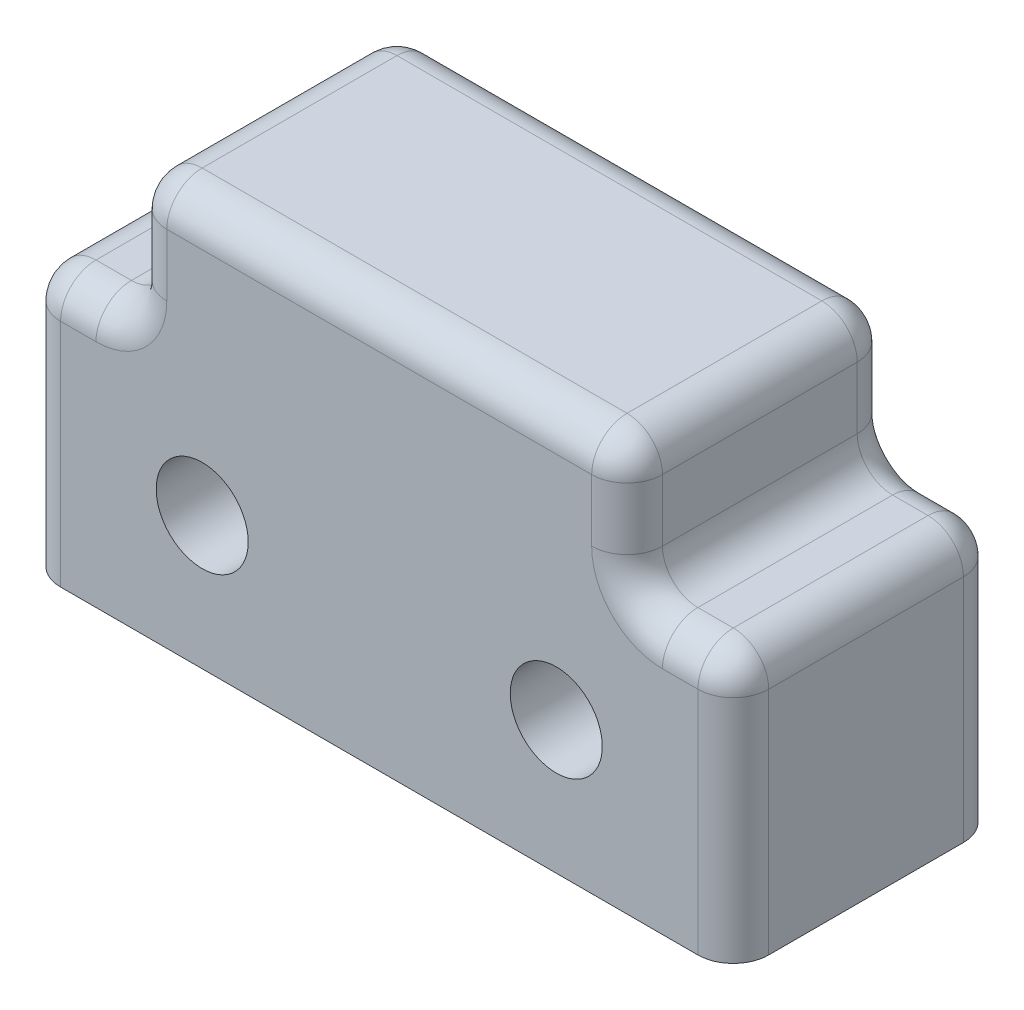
ISO-10303-21;
HEADER;
FILE_DESCRIPTION(('STEP AP214'),'2;1');
FILE_NAME('part.step','',(''),(''),'','','');
FILE_SCHEMA(('AUTOMOTIVE_DESIGN { 1 0 10303 214 1 1 1 1 }'));
ENDSEC;
DATA;
#1=APPLICATION_CONTEXT('core data for automotive mechanical design processes');
#2=APPLICATION_PROTOCOL_DEFINITION('international standard','automotive_design',2000,#1);
#3=PRODUCT_CONTEXT('',#1,'mechanical');
#4=PRODUCT('Part','Part','',(#3));
#5=PRODUCT_RELATED_PRODUCT_CATEGORY('part','',(#4));
#6=PRODUCT_DEFINITION_FORMATION('','',#4);
#7=PRODUCT_DEFINITION_CONTEXT('part definition',#1,'design');
#8=PRODUCT_DEFINITION('design','',#6,#7);
#9=PRODUCT_DEFINITION_SHAPE('','',#8);
#10=(LENGTH_UNIT() NAMED_UNIT(*) SI_UNIT(.MILLI.,.METRE.));
#11=(NAMED_UNIT(*) PLANE_ANGLE_UNIT() SI_UNIT($,.RADIAN.));
#12=(NAMED_UNIT(*) SI_UNIT($,.STERADIAN.) SOLID_ANGLE_UNIT());
#13=UNCERTAINTY_MEASURE_WITH_UNIT(LENGTH_MEASURE(1.E-05),#10,'distance_accuracy_value','');
#14=(GEOMETRIC_REPRESENTATION_CONTEXT(3) GLOBAL_UNCERTAINTY_ASSIGNED_CONTEXT((#13)) GLOBAL_UNIT_ASSIGNED_CONTEXT((#10,
#11,#12)) REPRESENTATION_CONTEXT('',''));
#15=CARTESIAN_POINT('',(0.,0.,0.));
#16=DIRECTION('',(0.,0.,1.));
#17=DIRECTION('',(1.,0.,0.));
#18=AXIS2_PLACEMENT_3D('',#15,#16,#17);
#19=CARTESIAN_POINT('',(0.,19.05,19.05));
#20=DIRECTION('',(0.,-1.,0.));
#21=DIRECTION('',(0.,0.,-1.));
#22=AXIS2_PLACEMENT_3D('',#19,#20,#21);
#23=PLANE('',#22);
#24=DIRECTION('',(0.,0.,-1.));
#25=VECTOR('',#24,1.);
#26=CARTESIAN_POINT('',(2.54,19.05,19.05));
#27=LINE('',#26,#25);
#28=CARTESIAN_POINT('',(2.54,19.05,2.54));
#29=VERTEX_POINT('',#28);
#30=CARTESIAN_POINT('',(2.54,19.05,16.51));
#31=VERTEX_POINT('',#30);
#32=EDGE_CURVE('E428',#29,#31,#27,.F.);
#33=ORIENTED_EDGE('',*,*,#32,.T.);
#34=DIRECTION('',(-1.,0.,0.));
#35=VECTOR('',#34,1.);
#36=CARTESIAN_POINT('',(0.,19.05,16.51));
#37=LINE('',#36,#35);
#38=CARTESIAN_POINT('',(5.08,19.05,16.51));
#39=VERTEX_POINT('',#38);
#40=EDGE_CURVE('E359',#31,#39,#37,.F.);
#41=ORIENTED_EDGE('',*,*,#40,.T.);
#42=DIRECTION('',(0.,0.,1.));
#43=VECTOR('',#42,1.);
#44=CARTESIAN_POINT('',(5.08,19.05,0.));
#45=LINE('',#44,#43);
#46=CARTESIAN_POINT('',(5.08,19.05,2.54));
#47=VERTEX_POINT('',#46);
#48=EDGE_CURVE('E426',#39,#47,#45,.F.);
#49=ORIENTED_EDGE('',*,*,#48,.T.);
#50=DIRECTION('',(-1.,0.,0.));
#51=VECTOR('',#50,1.);
#52=CARTESIAN_POINT('',(2.54,19.05,2.54));
#53=LINE('',#52,#51);
#54=EDGE_CURVE('E265',#47,#29,#53,.T.);
#55=ORIENTED_EDGE('',*,*,#54,.T.);
#56=EDGE_LOOP('',(#33,#41,#49,#55));
#57=FACE_BOUND('',#56,.T.);
#58=ADVANCED_FACE('F35',(#57),#23,.F.);
#59=DIRECTION('',(0.,0.,-1.));
#60=VECTOR('',#59,1.);
#61=CARTESIAN_POINT('',(45.72,19.05,19.05));
#62=LINE('',#61,#60);
#63=CARTESIAN_POINT('',(45.72,19.05,2.54));
#64=VERTEX_POINT('',#63);
#65=CARTESIAN_POINT('',(45.72,19.05,16.51));
#66=VERTEX_POINT('',#65);
#67=EDGE_CURVE('E235',#64,#66,#62,.F.);
#68=ORIENTED_EDGE('',*,*,#67,.T.);
#69=DIRECTION('',(-1.,0.,0.));
#70=VECTOR('',#69,1.);
#71=CARTESIAN_POINT('',(0.,19.05,16.51));
#72=LINE('',#71,#70);
#73=CARTESIAN_POINT('',(48.26,19.05,16.51));
#74=VERTEX_POINT('',#73);
#75=EDGE_CURVE('E342',#66,#74,#72,.F.);
#76=ORIENTED_EDGE('',*,*,#75,.T.);
#77=DIRECTION('',(0.,0.,-1.));
#78=VECTOR('',#77,1.);
#79=CARTESIAN_POINT('',(48.26,19.05,19.05));
#80=LINE('',#79,#78);
#81=CARTESIAN_POINT('',(48.26,19.05,2.54));
#82=VERTEX_POINT('',#81);
#83=EDGE_CURVE('E233',#74,#82,#80,.T.);
#84=ORIENTED_EDGE('',*,*,#83,.T.);
#85=DIRECTION('',(-1.,0.,0.));
#86=VECTOR('',#85,1.);
#87=CARTESIAN_POINT('',(45.72,19.05,2.54));
#88=LINE('',#87,#86);
#89=EDGE_CURVE('E217',#82,#64,#88,.T.);
#90=ORIENTED_EDGE('',*,*,#89,.T.);
#91=EDGE_LOOP('',(#68,#76,#84,#90));
#92=FACE_BOUND('',#91,.T.);
#93=ADVANCED_FACE('F448',(#92),#23,.F.);
#94=CARTESIAN_POINT('',(0.,0.,19.05));
#95=DIRECTION('',(1.,0.,0.));
#96=DIRECTION('',(0.,0.,-1.));
#97=AXIS2_PLACEMENT_3D('',#94,#95,#96);
#98=PLANE('',#97);
#99=DIRECTION('',(0.,0.,-1.));
#100=VECTOR('',#99,1.);
#101=CARTESIAN_POINT('',(0.,0.,19.05));
#102=LINE('',#101,#100);
#103=CARTESIAN_POINT('',(0.,0.,16.51));
#104=VERTEX_POINT('',#103);
#105=CARTESIAN_POINT('',(0.,0.,2.54000000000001));
#106=VERTEX_POINT('',#105);
#107=EDGE_CURVE('E415',#104,#106,#102,.T.);
#108=ORIENTED_EDGE('',*,*,#107,.F.);
#109=DIRECTION('',(0.,-1.,0.));
#110=VECTOR('',#109,1.);
#111=CARTESIAN_POINT('',(0.,0.,16.51));
#112=LINE('',#111,#110);
#113=CARTESIAN_POINT('',(0.,16.51,16.51));
#114=VERTEX_POINT('',#113);
#115=EDGE_CURVE('E44',#104,#114,#112,.F.);
#116=ORIENTED_EDGE('',*,*,#115,.T.);
#117=DIRECTION('',(0.,0.,-1.));
#118=VECTOR('',#117,1.);
#119=CARTESIAN_POINT('',(0.,16.51,19.05));
#120=LINE('',#119,#118);
#121=CARTESIAN_POINT('',(0.,16.51,2.54));
#122=VERTEX_POINT('',#121);
#123=EDGE_CURVE('E424',#114,#122,#120,.T.);
#124=ORIENTED_EDGE('',*,*,#123,.T.);
#125=DIRECTION('',(0.,-1.,0.));
#126=VECTOR('',#125,1.);
#127=CARTESIAN_POINT('',(0.,0.,2.54));
#128=LINE('',#127,#126);
#129=EDGE_CURVE('E259',#122,#106,#128,.T.);
#130=ORIENTED_EDGE('',*,*,#129,.T.);
#131=EDGE_LOOP('',(#108,#116,#124,#130));
#132=FACE_BOUND('',#131,.T.);
#133=ADVANCED_FACE('F485',(#132),#98,.F.);
#134=CARTESIAN_POINT('',(0.,0.,19.05));
#135=DIRECTION('',(0.,1.,0.));
#136=DIRECTION('',(0.,0.,1.));
#137=AXIS2_PLACEMENT_3D('',#134,#135,#136);
#138=PLANE('',#137);
#139=DIRECTION('',(0.,0.,-1.));
#140=VECTOR('',#139,1.);
#141=CARTESIAN_POINT('',(50.8,0.,19.05));
#142=LINE('',#141,#140);
#143=CARTESIAN_POINT('',(50.8,0.,16.51));
#144=VERTEX_POINT('',#143);
#145=CARTESIAN_POINT('',(50.8,0.,2.54000000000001));
#146=VERTEX_POINT('',#145);
#147=EDGE_CURVE('E226',#144,#146,#142,.T.);
#148=ORIENTED_EDGE('',*,*,#147,.F.);
#149=CARTESIAN_POINT('',(48.26,0.,16.51));
#150=DIRECTION('',(0.,1.,0.));
#151=DIRECTION('',(0.,0.,1.));
#152=AXIS2_PLACEMENT_3D('',#149,#150,#151);
#153=CIRCLE('',#152,2.54);
#154=CARTESIAN_POINT('',(48.26,0.,19.05));
#155=VERTEX_POINT('',#154);
#156=EDGE_CURVE('E349',#144,#155,#153,.F.);
#157=ORIENTED_EDGE('',*,*,#156,.T.);
#158=DIRECTION('',(1.,0.,0.));
#159=VECTOR('',#158,1.);
#160=CARTESIAN_POINT('',(0.,0.,19.05));
#161=LINE('',#160,#159);
#162=CARTESIAN_POINT('',(2.54,0.,19.05));
#163=VERTEX_POINT('',#162);
#164=EDGE_CURVE('E409',#163,#155,#161,.T.);
#165=ORIENTED_EDGE('',*,*,#164,.F.);
#166=CARTESIAN_POINT('',(2.54,0.,16.51));
#167=DIRECTION('',(0.,1.,0.));
#168=DIRECTION('',(0.,0.,1.));
#169=AXIS2_PLACEMENT_3D('',#166,#167,#168);
#170=CIRCLE('',#169,2.54);
#171=EDGE_CURVE('E347',#163,#104,#170,.F.);
#172=ORIENTED_EDGE('',*,*,#171,.T.);
#173=ORIENTED_EDGE('',*,*,#107,.T.);
#174=CARTESIAN_POINT('',(2.54,0.,2.54));
#175=DIRECTION('',(0.,1.,0.));
#176=DIRECTION('',(0.,0.,1.));
#177=AXIS2_PLACEMENT_3D('',#174,#175,#176);
#178=CIRCLE('',#177,2.54);
#179=CARTESIAN_POINT('',(2.54,0.,0.));
#180=VERTEX_POINT('',#179);
#181=EDGE_CURVE('E255',#106,#180,#178,.F.);
#182=ORIENTED_EDGE('',*,*,#181,.T.);
#183=DIRECTION('',(1.,0.,0.));
#184=VECTOR('',#183,1.);
#185=CARTESIAN_POINT('',(0.,0.,0.));
#186=LINE('',#185,#184);
#187=CARTESIAN_POINT('',(48.26,0.,0.));
#188=VERTEX_POINT('',#187);
#189=EDGE_CURVE('E317',#180,#188,#186,.T.);
#190=ORIENTED_EDGE('',*,*,#189,.T.);
#191=CARTESIAN_POINT('',(48.26,0.,2.54));
#192=DIRECTION('',(0.,1.,0.));
#193=DIRECTION('',(0.,0.,1.));
#194=AXIS2_PLACEMENT_3D('',#191,#192,#193);
#195=CIRCLE('',#194,2.54);
#196=EDGE_CURVE('E257',#188,#146,#195,.F.);
#197=ORIENTED_EDGE('',*,*,#196,.T.);
#198=EDGE_LOOP('',(#148,#157,#165,#172,#173,#182,#190,#197));
#199=FACE_BOUND('',#198,.T.);
#200=ADVANCED_FACE('F412',(#199),#138,.F.);
#201=CARTESIAN_POINT('',(50.8,0.,19.05));
#202=DIRECTION('',(-1.,0.,0.));
#203=DIRECTION('',(0.,0.,1.));
#204=AXIS2_PLACEMENT_3D('',#201,#202,#203);
#205=PLANE('',#204);
#206=DIRECTION('',(0.,0.,-1.));
#207=VECTOR('',#206,1.);
#208=CARTESIAN_POINT('',(50.8,16.51,19.05));
#209=LINE('',#208,#207);
#210=CARTESIAN_POINT('',(50.8,16.51,2.54));
#211=VERTEX_POINT('',#210);
#212=CARTESIAN_POINT('',(50.8,16.51,16.51));
#213=VERTEX_POINT('',#212);
#214=EDGE_CURVE('E223',#211,#213,#209,.F.);
#215=ORIENTED_EDGE('',*,*,#214,.T.);
#216=DIRECTION('',(0.,1.,0.));
#217=VECTOR('',#216,1.);
#218=CARTESIAN_POINT('',(50.8,0.,16.51));
#219=LINE('',#218,#217);
#220=EDGE_CURVE('E345',#213,#144,#219,.F.);
#221=ORIENTED_EDGE('',*,*,#220,.T.);
#222=ORIENTED_EDGE('',*,*,#147,.T.);
#223=DIRECTION('',(0.,1.,0.));
#224=VECTOR('',#223,1.);
#225=CARTESIAN_POINT('',(50.8,16.51,2.54));
#226=LINE('',#225,#224);
#227=EDGE_CURVE('E203',#146,#211,#226,.T.);
#228=ORIENTED_EDGE('',*,*,#227,.T.);
#229=EDGE_LOOP('',(#215,#221,#222,#228));
#230=FACE_BOUND('',#229,.T.);
#231=ADVANCED_FACE('F222',(#230),#205,.F.);
#232=CARTESIAN_POINT('',(0.,0.,19.05));
#233=DIRECTION('',(0.,0.,-1.));
#234=DIRECTION('',(-1.,0.,0.));
#235=AXIS2_PLACEMENT_3D('',#232,#233,#234);
#236=PLANE('',#235);
#237=ORIENTED_EDGE('',*,*,#164,.T.);
#238=DIRECTION('',(0.,1.,0.));
#239=VECTOR('',#238,1.);
#240=CARTESIAN_POINT('',(48.26,0.,19.05));
#241=LINE('',#240,#239);
#242=CARTESIAN_POINT('',(48.26,16.51,19.05));
#243=VERTEX_POINT('',#242);
#244=EDGE_CURVE('E338',#155,#243,#241,.T.);
#245=ORIENTED_EDGE('',*,*,#244,.T.);
#246=DIRECTION('',(-1.,0.,0.));
#247=VECTOR('',#246,1.);
#248=CARTESIAN_POINT('',(0.,16.51,19.05));
#249=LINE('',#248,#247);
#250=CARTESIAN_POINT('',(45.72,16.51,19.05));
#251=VERTEX_POINT('',#250);
#252=EDGE_CURVE('E336',#243,#251,#249,.T.);
#253=ORIENTED_EDGE('',*,*,#252,.T.);
#254=CARTESIAN_POINT('',(45.72,21.59,19.05));
#255=DIRECTION('',(0.,0.,-1.));
#256=DIRECTION('',(-1.,0.,0.));
#257=AXIS2_PLACEMENT_3D('',#254,#255,#256);
#258=CIRCLE('',#257,5.08);
#259=CARTESIAN_POINT('',(40.64,21.59,19.05));
#260=VERTEX_POINT('',#259);
#261=EDGE_CURVE('E334',#251,#260,#258,.T.);
#262=ORIENTED_EDGE('',*,*,#261,.T.);
#263=DIRECTION('',(0.,-1.,0.));
#264=VECTOR('',#263,1.);
#265=CARTESIAN_POINT('',(40.64,0.,19.05));
#266=LINE('',#265,#264);
#267=CARTESIAN_POINT('',(40.64,26.035,19.05));
#268=VERTEX_POINT('',#267);
#269=EDGE_CURVE('E332',#260,#268,#266,.F.);
#270=ORIENTED_EDGE('',*,*,#269,.T.);
#271=DIRECTION('',(1.,0.,0.));
#272=VECTOR('',#271,1.);
#273=CARTESIAN_POINT('',(10.16,26.035,19.05));
#274=LINE('',#273,#272);
#275=CARTESIAN_POINT('',(10.16,26.035,19.05));
#276=VERTEX_POINT('',#275);
#277=EDGE_CURVE('E330',#268,#276,#274,.F.);
#278=ORIENTED_EDGE('',*,*,#277,.T.);
#279=DIRECTION('',(0.,-1.,0.));
#280=VECTOR('',#279,1.);
#281=CARTESIAN_POINT('',(10.16,0.,19.05));
#282=LINE('',#281,#280);
#283=CARTESIAN_POINT('',(10.16,21.59,19.05));
#284=VERTEX_POINT('',#283);
#285=EDGE_CURVE('E328',#276,#284,#282,.T.);
#286=ORIENTED_EDGE('',*,*,#285,.T.);
#287=CARTESIAN_POINT('',(5.08,21.59,19.05));
#288=DIRECTION('',(0.,0.,-1.));
#289=DIRECTION('',(-1.,0.,0.));
#290=AXIS2_PLACEMENT_3D('',#287,#288,#289);
#291=CIRCLE('',#290,5.08);
#292=CARTESIAN_POINT('',(5.08,16.51,19.05));
#293=VERTEX_POINT('',#292);
#294=EDGE_CURVE('E326',#284,#293,#291,.T.);
#295=ORIENTED_EDGE('',*,*,#294,.T.);
#296=DIRECTION('',(-1.,0.,0.));
#297=VECTOR('',#296,1.);
#298=CARTESIAN_POINT('',(0.,16.51,19.05));
#299=LINE('',#298,#297);
#300=CARTESIAN_POINT('',(2.54,16.51,19.05));
#301=VERTEX_POINT('',#300);
#302=EDGE_CURVE('E324',#293,#301,#299,.T.);
#303=ORIENTED_EDGE('',*,*,#302,.T.);
#304=DIRECTION('',(0.,-1.,0.));
#305=VECTOR('',#304,1.);
#306=CARTESIAN_POINT('',(2.54,0.,19.05));
#307=LINE('',#306,#305);
#308=EDGE_CURVE('E322',#301,#163,#307,.T.);
#309=ORIENTED_EDGE('',*,*,#308,.T.);
#310=EDGE_LOOP('',(#237,#245,#253,#262,#270,#278,#286,#295,#303,#309));
#311=FACE_BOUND('',#310,.T.);
#312=CARTESIAN_POINT('',(12.7,9.525,19.05));
#313=DIRECTION('',(0.,0.,1.));
#314=DIRECTION('',(1.,0.,0.));
#315=AXIS2_PLACEMENT_3D('',#312,#313,#314);
#316=CIRCLE('',#315,3.302);
#317=CARTESIAN_POINT('',(16.002,9.525,19.05));
#318=VERTEX_POINT('',#317);
#319=EDGE_CURVE('E420',#318,#318,#316,.T.);
#320=ORIENTED_EDGE('',*,*,#319,.F.);
#321=EDGE_LOOP('',(#320));
#322=FACE_BOUND('',#321,.T.);
#323=CARTESIAN_POINT('',(38.1,9.525,19.05));
#324=DIRECTION('',(0.,0.,-1.));
#325=DIRECTION('',(-1.,0.,0.));
#326=AXIS2_PLACEMENT_3D('',#323,#324,#325);
#327=CIRCLE('',#326,3.302);
#328=CARTESIAN_POINT('',(34.798,9.525,19.05));
#329=VERTEX_POINT('',#328);
#330=EDGE_CURVE('E974',#329,#329,#327,.T.);
#331=ORIENTED_EDGE('',*,*,#330,.T.);
#332=EDGE_LOOP('',(#331));
#333=FACE_BOUND('',#332,.T.);
#334=ADVANCED_FACE('F407',(#311,#322,#333),#236,.F.);
#335=CARTESIAN_POINT('',(0.,0.,0.));
#336=DIRECTION('',(0.,0.,-1.));
#337=DIRECTION('',(-1.,0.,0.));
#338=AXIS2_PLACEMENT_3D('',#335,#336,#337);
#339=PLANE('',#338);
#340=DIRECTION('',(-1.,0.,0.));
#341=VECTOR('',#340,1.);
#342=CARTESIAN_POINT('',(48.26,16.51,0.));
#343=LINE('',#342,#341);
#344=CARTESIAN_POINT('',(45.72,16.51,0.));
#345=VERTEX_POINT('',#344);
#346=CARTESIAN_POINT('',(48.26,16.51,0.));
#347=VERTEX_POINT('',#346);
#348=EDGE_CURVE('E244',#345,#347,#343,.F.);
#349=ORIENTED_EDGE('',*,*,#348,.T.);
#350=DIRECTION('',(0.,1.,0.));
#351=VECTOR('',#350,1.);
#352=CARTESIAN_POINT('',(48.26,0.,0.));
#353=LINE('',#352,#351);
#354=EDGE_CURVE('E204',#347,#188,#353,.F.);
#355=ORIENTED_EDGE('',*,*,#354,.T.);
#356=ORIENTED_EDGE('',*,*,#189,.F.);
#357=DIRECTION('',(0.,-1.,0.));
#358=VECTOR('',#357,1.);
#359=CARTESIAN_POINT('',(2.54,16.51,0.));
#360=LINE('',#359,#358);
#361=CARTESIAN_POINT('',(2.54,16.51,0.));
#362=VERTEX_POINT('',#361);
#363=EDGE_CURVE('E252',#180,#362,#360,.F.);
#364=ORIENTED_EDGE('',*,*,#363,.T.);
#365=DIRECTION('',(-1.,0.,0.));
#366=VECTOR('',#365,1.);
#367=CARTESIAN_POINT('',(5.08,16.51,0.));
#368=LINE('',#367,#366);
#369=CARTESIAN_POINT('',(5.08,16.51,0.));
#370=VERTEX_POINT('',#369);
#371=EDGE_CURVE('E250',#362,#370,#368,.F.);
#372=ORIENTED_EDGE('',*,*,#371,.T.);
#373=CARTESIAN_POINT('',(5.08,21.59,0.));
#374=DIRECTION('',(0.,0.,-1.));
#375=DIRECTION('',(-1.,0.,0.));
#376=AXIS2_PLACEMENT_3D('',#373,#374,#375);
#377=CIRCLE('',#376,5.08);
#378=CARTESIAN_POINT('',(10.16,21.59,0.));
#379=VERTEX_POINT('',#378);
#380=EDGE_CURVE('E248',#370,#379,#377,.F.);
#381=ORIENTED_EDGE('',*,*,#380,.T.);
#382=DIRECTION('',(0.,-1.,0.));
#383=VECTOR('',#382,1.);
#384=CARTESIAN_POINT('',(10.16,26.035,0.));
#385=LINE('',#384,#383);
#386=CARTESIAN_POINT('',(10.16,26.035,0.));
#387=VERTEX_POINT('',#386);
#388=EDGE_CURVE('E246',#379,#387,#385,.F.);
#389=ORIENTED_EDGE('',*,*,#388,.T.);
#390=DIRECTION('',(-1.,0.,0.));
#391=VECTOR('',#390,1.);
#392=CARTESIAN_POINT('',(0.,26.035,0.));
#393=LINE('',#392,#391);
#394=CARTESIAN_POINT('',(40.64,26.035,0.));
#395=VERTEX_POINT('',#394);
#396=EDGE_CURVE('E228',#387,#395,#393,.F.);
#397=ORIENTED_EDGE('',*,*,#396,.T.);
#398=DIRECTION('',(0.,-1.,0.));
#399=VECTOR('',#398,1.);
#400=CARTESIAN_POINT('',(40.64,21.59,0.));
#401=LINE('',#400,#399);
#402=CARTESIAN_POINT('',(40.64,21.59,0.));
#403=VERTEX_POINT('',#402);
#404=EDGE_CURVE('E240',#395,#403,#401,.T.);
#405=ORIENTED_EDGE('',*,*,#404,.T.);
#406=CARTESIAN_POINT('',(45.72,21.59,0.));
#407=DIRECTION('',(0.,0.,-1.));
#408=DIRECTION('',(-1.,0.,0.));
#409=AXIS2_PLACEMENT_3D('',#406,#407,#408);
#410=CIRCLE('',#409,5.08);
#411=EDGE_CURVE('E242',#403,#345,#410,.F.);
#412=ORIENTED_EDGE('',*,*,#411,.T.);
#413=EDGE_LOOP('',(#349,#355,#356,#364,#372,#381,#389,#397,#405,#412));
#414=FACE_BOUND('',#413,.T.);
#415=CARTESIAN_POINT('',(12.7,9.525,0.));
#416=DIRECTION('',(0.,0.,1.));
#417=DIRECTION('',(1.,0.,0.));
#418=AXIS2_PLACEMENT_3D('',#415,#416,#417);
#419=CIRCLE('',#418,3.302);
#420=CARTESIAN_POINT('',(16.002,9.525,0.));
#421=VERTEX_POINT('',#420);
#422=EDGE_CURVE('E366',#421,#421,#419,.T.);
#423=ORIENTED_EDGE('',*,*,#422,.T.);
#424=EDGE_LOOP('',(#423));
#425=FACE_BOUND('',#424,.T.);
#426=CARTESIAN_POINT('',(38.1,9.525,0.));
#427=DIRECTION('',(0.,0.,-1.));
#428=DIRECTION('',(-1.,0.,0.));
#429=AXIS2_PLACEMENT_3D('',#426,#427,#428);
#430=CIRCLE('',#429,3.302);
#431=CARTESIAN_POINT('',(34.798,9.525,0.));
#432=VERTEX_POINT('',#431);
#433=EDGE_CURVE('E972',#432,#432,#430,.T.);
#434=ORIENTED_EDGE('',*,*,#433,.F.);
#435=EDGE_LOOP('',(#434));
#436=FACE_BOUND('',#435,.T.);
#437=ADVANCED_FACE('F488',(#414,#425,#436),#339,.T.);
#438=CARTESIAN_POINT('',(7.62,28.575,0.));
#439=DIRECTION('',(1.,0.,0.));
#440=DIRECTION('',(0.,0.,-1.));
#441=AXIS2_PLACEMENT_3D('',#438,#439,#440);
#442=PLANE('',#441);
#443=DIRECTION('',(0.,0.,1.));
#444=VECTOR('',#443,1.);
#445=CARTESIAN_POINT('',(7.62,21.59,19.05));
#446=LINE('',#445,#444);
#447=CARTESIAN_POINT('',(7.62,21.59,2.54));
#448=VERTEX_POINT('',#447);
#449=CARTESIAN_POINT('',(7.62,21.59,16.51));
#450=VERTEX_POINT('',#449);
#451=EDGE_CURVE('E432',#448,#450,#446,.T.);
#452=ORIENTED_EDGE('',*,*,#451,.T.);
#453=DIRECTION('',(0.,-1.,0.));
#454=VECTOR('',#453,1.);
#455=CARTESIAN_POINT('',(7.62,28.575,16.51));
#456=LINE('',#455,#454);
#457=CARTESIAN_POINT('',(7.62,26.035,16.51));
#458=VERTEX_POINT('',#457);
#459=EDGE_CURVE('E355',#450,#458,#456,.F.);
#460=ORIENTED_EDGE('',*,*,#459,.T.);
#461=DIRECTION('',(0.,0.,1.));
#462=VECTOR('',#461,1.);
#463=CARTESIAN_POINT('',(7.62,26.035,0.));
#464=LINE('',#463,#462);
#465=CARTESIAN_POINT('',(7.62,26.035,2.54));
#466=VERTEX_POINT('',#465);
#467=EDGE_CURVE('E430',#458,#466,#464,.F.);
#468=ORIENTED_EDGE('',*,*,#467,.T.);
#469=DIRECTION('',(0.,-1.,0.));
#470=VECTOR('',#469,1.);
#471=CARTESIAN_POINT('',(7.62,21.59,2.54));
#472=LINE('',#471,#470);
#473=EDGE_CURVE('E270',#466,#448,#472,.T.);
#474=ORIENTED_EDGE('',*,*,#473,.T.);
#475=EDGE_LOOP('',(#452,#460,#468,#474));
#476=FACE_BOUND('',#475,.T.);
#477=ADVANCED_FACE('F641',(#476),#442,.F.);
#478=CARTESIAN_POINT('',(43.18,28.575,0.));
#479=DIRECTION('',(-1.,0.,0.));
#480=DIRECTION('',(0.,0.,1.));
#481=AXIS2_PLACEMENT_3D('',#478,#479,#480);
#482=PLANE('',#481);
#483=DIRECTION('',(0.,0.,-1.));
#484=VECTOR('',#483,1.);
#485=CARTESIAN_POINT('',(43.18,26.035,19.05));
#486=LINE('',#485,#484);
#487=CARTESIAN_POINT('',(43.18,26.035,2.54));
#488=VERTEX_POINT('',#487);
#489=CARTESIAN_POINT('',(43.18,26.035,16.51));
#490=VERTEX_POINT('',#489);
#491=EDGE_CURVE('E442',#488,#490,#486,.F.);
#492=ORIENTED_EDGE('',*,*,#491,.T.);
#493=DIRECTION('',(0.,-1.,0.));
#494=VECTOR('',#493,1.);
#495=CARTESIAN_POINT('',(43.18,28.575,16.51));
#496=LINE('',#495,#494);
#497=CARTESIAN_POINT('',(43.18,21.59,16.51));
#498=VERTEX_POINT('',#497);
#499=EDGE_CURVE('E320',#490,#498,#496,.T.);
#500=ORIENTED_EDGE('',*,*,#499,.T.);
#501=DIRECTION('',(0.,0.,-1.));
#502=VECTOR('',#501,1.);
#503=CARTESIAN_POINT('',(43.18,21.59,0.));
#504=LINE('',#503,#502);
#505=CARTESIAN_POINT('',(43.18,21.59,2.54));
#506=VERTEX_POINT('',#505);
#507=EDGE_CURVE('E440',#498,#506,#504,.T.);
#508=ORIENTED_EDGE('',*,*,#507,.T.);
#509=DIRECTION('',(0.,-1.,0.));
#510=VECTOR('',#509,1.);
#511=CARTESIAN_POINT('',(43.18,26.035,2.54));
#512=LINE('',#511,#510);
#513=EDGE_CURVE('E278',#506,#488,#512,.F.);
#514=ORIENTED_EDGE('',*,*,#513,.T.);
#515=EDGE_LOOP('',(#492,#500,#508,#514));
#516=FACE_BOUND('',#515,.T.);
#517=ADVANCED_FACE('F795',(#516),#482,.F.);
#518=CARTESIAN_POINT('',(0.,28.575,0.));
#519=DIRECTION('',(0.,1.,0.));
#520=DIRECTION('',(0.,0.,1.));
#521=AXIS2_PLACEMENT_3D('',#518,#519,#520);
#522=PLANE('',#521);
#523=DIRECTION('',(0.,0.,1.));
#524=VECTOR('',#523,1.);
#525=CARTESIAN_POINT('',(10.16,28.575,19.05));
#526=LINE('',#525,#524);
#527=CARTESIAN_POINT('',(10.16,28.575,2.54));
#528=VERTEX_POINT('',#527);
#529=CARTESIAN_POINT('',(10.16,28.575,16.51));
#530=VERTEX_POINT('',#529);
#531=EDGE_CURVE('E437',#528,#530,#526,.T.);
#532=ORIENTED_EDGE('',*,*,#531,.T.);
#533=DIRECTION('',(1.,0.,0.));
#534=VECTOR('',#533,1.);
#535=CARTESIAN_POINT('',(40.64,28.575,16.51));
#536=LINE('',#535,#534);
#537=CARTESIAN_POINT('',(40.64,28.575,16.51));
#538=VERTEX_POINT('',#537);
#539=EDGE_CURVE('E351',#530,#538,#536,.T.);
#540=ORIENTED_EDGE('',*,*,#539,.T.);
#541=DIRECTION('',(0.,0.,-1.));
#542=VECTOR('',#541,1.);
#543=CARTESIAN_POINT('',(40.64,28.575,0.));
#544=LINE('',#543,#542);
#545=CARTESIAN_POINT('',(40.64,28.575,2.54));
#546=VERTEX_POINT('',#545);
#547=EDGE_CURVE('E435',#538,#546,#544,.T.);
#548=ORIENTED_EDGE('',*,*,#547,.T.);
#549=DIRECTION('',(-1.,0.,0.));
#550=VECTOR('',#549,1.);
#551=CARTESIAN_POINT('',(0.,28.575,2.54));
#552=LINE('',#551,#550);
#553=EDGE_CURVE('E283',#546,#528,#552,.T.);
#554=ORIENTED_EDGE('',*,*,#553,.T.);
#555=EDGE_LOOP('',(#532,#540,#548,#554));
#556=FACE_BOUND('',#555,.T.);
#557=ADVANCED_FACE('F500',(#556),#522,.T.);
#558=CARTESIAN_POINT('',(2.54,16.51,19.05));
#559=DIRECTION('',(0.,0.,-1.));
#560=DIRECTION('',(-1.,0.,0.));
#561=AXIS2_PLACEMENT_3D('',#558,#559,#560);
#562=CYLINDRICAL_SURFACE('',#561,2.54);
#563=ORIENTED_EDGE('',*,*,#123,.F.);
#564=CARTESIAN_POINT('',(2.54,16.51,16.51));
#565=DIRECTION('',(0.,0.,-1.));
#566=DIRECTION('',(-1.,0.,0.));
#567=AXIS2_PLACEMENT_3D('',#564,#565,#566);
#568=CIRCLE('',#567,2.54);
#569=EDGE_CURVE('E11',#114,#31,#568,.T.);
#570=ORIENTED_EDGE('',*,*,#569,.T.);
#571=ORIENTED_EDGE('',*,*,#32,.F.);
#572=CARTESIAN_POINT('',(2.54,16.51,2.54));
#573=DIRECTION('',(0.,0.,-1.));
#574=DIRECTION('',(-1.,0.,0.));
#575=AXIS2_PLACEMENT_3D('',#572,#573,#574);
#576=CIRCLE('',#575,2.54);
#577=EDGE_CURVE('E262',#29,#122,#576,.F.);
#578=ORIENTED_EDGE('',*,*,#577,.T.);
#579=EDGE_LOOP('',(#563,#570,#571,#578));
#580=FACE_BOUND('',#579,.T.);
#581=ADVANCED_FACE('F496',(#580),#562,.T.);
#582=CARTESIAN_POINT('',(5.08,21.59,0.));
#583=DIRECTION('',(0.,0.,-1.));
#584=DIRECTION('',(-1.,0.,0.));
#585=AXIS2_PLACEMENT_3D('',#582,#583,#584);
#586=CYLINDRICAL_SURFACE('',#585,2.54);
#587=ORIENTED_EDGE('',*,*,#48,.F.);
#588=CARTESIAN_POINT('',(5.08,21.59,16.51));
#589=DIRECTION('',(0.,0.,-1.));
#590=DIRECTION('',(-1.,0.,0.));
#591=AXIS2_PLACEMENT_3D('',#588,#589,#590);
#592=CIRCLE('',#591,2.54);
#593=EDGE_CURVE('E357',#39,#450,#592,.F.);
#594=ORIENTED_EDGE('',*,*,#593,.T.);
#595=ORIENTED_EDGE('',*,*,#451,.F.);
#596=CARTESIAN_POINT('',(5.08,21.59,2.54));
#597=DIRECTION('',(0.,0.,-1.));
#598=DIRECTION('',(-1.,0.,0.));
#599=AXIS2_PLACEMENT_3D('',#596,#597,#598);
#600=CIRCLE('',#599,2.54);
#601=EDGE_CURVE('E267',#448,#47,#600,.T.);
#602=ORIENTED_EDGE('',*,*,#601,.T.);
#603=EDGE_LOOP('',(#587,#594,#595,#602));
#604=FACE_BOUND('',#603,.T.);
#605=ADVANCED_FACE('F499',(#604),#586,.F.);
#606=CARTESIAN_POINT('',(10.16,26.035,0.));
#607=DIRECTION('',(0.,0.,-1.));
#608=DIRECTION('',(-1.,0.,0.));
#609=AXIS2_PLACEMENT_3D('',#606,#607,#608);
#610=CYLINDRICAL_SURFACE('',#609,2.54);
#611=ORIENTED_EDGE('',*,*,#467,.F.);
#612=CARTESIAN_POINT('',(10.16,26.035,16.51));
#613=DIRECTION('',(0.,0.,-1.));
#614=DIRECTION('',(-1.,0.,0.));
#615=AXIS2_PLACEMENT_3D('',#612,#613,#614);
#616=CIRCLE('',#615,2.54);
#617=EDGE_CURVE('E353',#458,#530,#616,.T.);
#618=ORIENTED_EDGE('',*,*,#617,.T.);
#619=ORIENTED_EDGE('',*,*,#531,.F.);
#620=CARTESIAN_POINT('',(10.16,26.035,2.54));
#621=DIRECTION('',(0.,0.,-1.));
#622=DIRECTION('',(-1.,0.,0.));
#623=AXIS2_PLACEMENT_3D('',#620,#621,#622);
#624=CIRCLE('',#623,2.54);
#625=EDGE_CURVE('E218',#528,#466,#624,.F.);
#626=ORIENTED_EDGE('',*,*,#625,.T.);
#627=EDGE_LOOP('',(#611,#618,#619,#626));
#628=FACE_BOUND('',#627,.T.);
#629=ADVANCED_FACE('F503',(#628),#610,.T.);
#630=CARTESIAN_POINT('',(40.64,26.035,0.));
#631=DIRECTION('',(0.,0.,1.));
#632=DIRECTION('',(1.,0.,0.));
#633=AXIS2_PLACEMENT_3D('',#630,#631,#632);
#634=CYLINDRICAL_SURFACE('',#633,2.54);
#635=ORIENTED_EDGE('',*,*,#547,.F.);
#636=CARTESIAN_POINT('',(40.64,26.035,16.51));
#637=DIRECTION('',(0.,0.,1.));
#638=DIRECTION('',(1.,0.,0.));
#639=AXIS2_PLACEMENT_3D('',#636,#637,#638);
#640=CIRCLE('',#639,2.54);
#641=EDGE_CURVE('E284',#538,#490,#640,.F.);
#642=ORIENTED_EDGE('',*,*,#641,.T.);
#643=ORIENTED_EDGE('',*,*,#491,.F.);
#644=CARTESIAN_POINT('',(40.64,26.035,2.54));
#645=DIRECTION('',(0.,0.,1.));
#646=DIRECTION('',(1.,0.,0.));
#647=AXIS2_PLACEMENT_3D('',#644,#645,#646);
#648=CIRCLE('',#647,2.54);
#649=EDGE_CURVE('E280',#488,#546,#648,.T.);
#650=ORIENTED_EDGE('',*,*,#649,.T.);
#651=EDGE_LOOP('',(#635,#642,#643,#650));
#652=FACE_BOUND('',#651,.T.);
#653=ADVANCED_FACE('F507',(#652),#634,.T.);
#654=CARTESIAN_POINT('',(48.26,16.51,19.05));
#655=DIRECTION('',(0.,0.,-1.));
#656=DIRECTION('',(-1.,0.,0.));
#657=AXIS2_PLACEMENT_3D('',#654,#655,#656);
#658=CYLINDRICAL_SURFACE('',#657,2.54);
#659=ORIENTED_EDGE('',*,*,#83,.F.);
#660=CARTESIAN_POINT('',(48.26,16.51,16.51));
#661=DIRECTION('',(0.,0.,-1.));
#662=DIRECTION('',(-1.,0.,0.));
#663=AXIS2_PLACEMENT_3D('',#660,#661,#662);
#664=CIRCLE('',#663,2.54);
#665=EDGE_CURVE('E232',#74,#213,#664,.T.);
#666=ORIENTED_EDGE('',*,*,#665,.T.);
#667=ORIENTED_EDGE('',*,*,#214,.F.);
#668=CARTESIAN_POINT('',(48.26,16.51,2.54));
#669=DIRECTION('',(0.,0.,-1.));
#670=DIRECTION('',(-1.,0.,0.));
#671=AXIS2_PLACEMENT_3D('',#668,#669,#670);
#672=CIRCLE('',#671,2.54);
#673=EDGE_CURVE('E210',#211,#82,#672,.F.);
#674=ORIENTED_EDGE('',*,*,#673,.T.);
#675=EDGE_LOOP('',(#659,#666,#667,#674));
#676=FACE_BOUND('',#675,.T.);
#677=ADVANCED_FACE('F230',(#676),#658,.T.);
#678=CARTESIAN_POINT('',(45.72,21.59,0.));
#679=DIRECTION('',(0.,0.,1.));
#680=DIRECTION('',(1.,0.,0.));
#681=AXIS2_PLACEMENT_3D('',#678,#679,#680);
#682=CYLINDRICAL_SURFACE('',#681,2.54);
#683=ORIENTED_EDGE('',*,*,#507,.F.);
#684=CARTESIAN_POINT('',(45.72,21.59,16.51));
#685=DIRECTION('',(0.,0.,-1.));
#686=DIRECTION('',(-1.,0.,0.));
#687=AXIS2_PLACEMENT_3D('',#684,#685,#686);
#688=CIRCLE('',#687,2.54);
#689=EDGE_CURVE('E340',#498,#66,#688,.F.);
#690=ORIENTED_EDGE('',*,*,#689,.T.);
#691=ORIENTED_EDGE('',*,*,#67,.F.);
#692=CARTESIAN_POINT('',(45.72,21.59,2.54));
#693=DIRECTION('',(0.,0.,-1.));
#694=DIRECTION('',(-1.,0.,0.));
#695=AXIS2_PLACEMENT_3D('',#692,#693,#694);
#696=CIRCLE('',#695,2.54);
#697=EDGE_CURVE('E275',#64,#506,#696,.T.);
#698=ORIENTED_EDGE('',*,*,#697,.T.);
#699=EDGE_LOOP('',(#683,#690,#691,#698));
#700=FACE_BOUND('',#699,.T.);
#701=ADVANCED_FACE('F514',(#700),#682,.F.);
#702=CARTESIAN_POINT('',(2.54,0.,2.54));
#703=DIRECTION('',(0.,1.,0.));
#704=DIRECTION('',(0.,0.,1.));
#705=AXIS2_PLACEMENT_3D('',#702,#703,#704);
#706=CYLINDRICAL_SURFACE('',#705,2.54);
#707=ORIENTED_EDGE('',*,*,#181,.F.);
#708=ORIENTED_EDGE('',*,*,#129,.F.);
#709=CARTESIAN_POINT('',(2.54,16.51,2.54));
#710=DIRECTION('',(0.,1.,0.));
#711=DIRECTION('',(0.,0.,1.));
#712=AXIS2_PLACEMENT_3D('',#709,#710,#711);
#713=CIRCLE('',#712,2.54);
#714=EDGE_CURVE('E314',#362,#122,#713,.T.);
#715=ORIENTED_EDGE('',*,*,#714,.F.);
#716=ORIENTED_EDGE('',*,*,#363,.F.);
#717=EDGE_LOOP('',(#707,#708,#715,#716));
#718=FACE_BOUND('',#717,.T.);
#719=ADVANCED_FACE('F517',(#718),#706,.T.);
#720=CARTESIAN_POINT('',(2.54,16.51,2.54));
#721=DIRECTION('',(0.,0.,-1.));
#722=DIRECTION('',(-1.,0.,0.));
#723=AXIS2_PLACEMENT_3D('',#720,#721,#722);
#724=SPHERICAL_SURFACE('',#723,2.54);
#725=ORIENTED_EDGE('',*,*,#714,.T.);
#726=ORIENTED_EDGE('',*,*,#577,.F.);
#727=CARTESIAN_POINT('',(2.54,16.51,2.54));
#728=DIRECTION('',(1.,0.,0.));
#729=DIRECTION('',(0.,0.,-1.));
#730=AXIS2_PLACEMENT_3D('',#727,#728,#729);
#731=CIRCLE('',#730,2.54);
#732=EDGE_CURVE('E311',#362,#29,#731,.T.);
#733=ORIENTED_EDGE('',*,*,#732,.F.);
#734=EDGE_LOOP('',(#725,#726,#733));
#735=FACE_BOUND('',#734,.T.);
#736=ADVANCED_FACE('F557',(#735),#724,.T.);
#737=CARTESIAN_POINT('',(0.,16.51,2.54));
#738=DIRECTION('',(1.,0.,0.));
#739=DIRECTION('',(0.,0.,-1.));
#740=AXIS2_PLACEMENT_3D('',#737,#738,#739);
#741=CYLINDRICAL_SURFACE('',#740,2.54);
#742=ORIENTED_EDGE('',*,*,#732,.T.);
#743=ORIENTED_EDGE('',*,*,#54,.F.);
#744=CARTESIAN_POINT('',(5.08,16.51,2.54));
#745=DIRECTION('',(1.,0.,0.));
#746=DIRECTION('',(0.,0.,-1.));
#747=AXIS2_PLACEMENT_3D('',#744,#745,#746);
#748=CIRCLE('',#747,2.54);
#749=EDGE_CURVE('E308',#370,#47,#748,.T.);
#750=ORIENTED_EDGE('',*,*,#749,.F.);
#751=ORIENTED_EDGE('',*,*,#371,.F.);
#752=EDGE_LOOP('',(#742,#743,#750,#751));
#753=FACE_BOUND('',#752,.T.);
#754=ADVANCED_FACE('F553',(#753),#741,.T.);
#755=CARTESIAN_POINT('',(5.08,21.59,2.54));
#756=DIRECTION('',(0.,0.,-1.));
#757=DIRECTION('',(-1.,0.,0.));
#758=AXIS2_PLACEMENT_3D('',#755,#756,#757);
#759=TOROIDAL_SURFACE('',#758,5.08,2.54);
#760=ORIENTED_EDGE('',*,*,#749,.T.);
#761=ORIENTED_EDGE('',*,*,#601,.F.);
#762=CARTESIAN_POINT('',(10.16,21.59,2.54));
#763=DIRECTION('',(0.,1.,0.));
#764=DIRECTION('',(0.,0.,1.));
#765=AXIS2_PLACEMENT_3D('',#762,#763,#764);
#766=CIRCLE('',#765,2.54);
#767=EDGE_CURVE('E305',#379,#448,#766,.T.);
#768=ORIENTED_EDGE('',*,*,#767,.F.);
#769=ORIENTED_EDGE('',*,*,#380,.F.);
#770=EDGE_LOOP('',(#760,#761,#768,#769));
#771=FACE_BOUND('',#770,.T.);
#772=ADVANCED_FACE('F549',(#771),#759,.T.);
#773=CARTESIAN_POINT('',(10.16,28.575,2.54));
#774=DIRECTION('',(0.,1.,0.));
#775=DIRECTION('',(0.,0.,1.));
#776=AXIS2_PLACEMENT_3D('',#773,#774,#775);
#777=CYLINDRICAL_SURFACE('',#776,2.54);
#778=ORIENTED_EDGE('',*,*,#767,.T.);
#779=ORIENTED_EDGE('',*,*,#473,.F.);
#780=CARTESIAN_POINT('',(10.16,26.035,2.54));
#781=DIRECTION('',(0.,1.,0.));
#782=DIRECTION('',(0.,0.,1.));
#783=AXIS2_PLACEMENT_3D('',#780,#781,#782);
#784=CIRCLE('',#783,2.54);
#785=EDGE_CURVE('E302',#387,#466,#784,.T.);
#786=ORIENTED_EDGE('',*,*,#785,.F.);
#787=ORIENTED_EDGE('',*,*,#388,.F.);
#788=EDGE_LOOP('',(#778,#779,#786,#787));
#789=FACE_BOUND('',#788,.T.);
#790=ADVANCED_FACE('F545',(#789),#777,.T.);
#791=CARTESIAN_POINT('',(10.16,26.035,2.54));
#792=DIRECTION('',(0.,0.,-1.));
#793=DIRECTION('',(-1.,0.,0.));
#794=AXIS2_PLACEMENT_3D('',#791,#792,#793);
#795=SPHERICAL_SURFACE('',#794,2.54);
#796=ORIENTED_EDGE('',*,*,#785,.T.);
#797=ORIENTED_EDGE('',*,*,#625,.F.);
#798=CARTESIAN_POINT('',(10.16,26.035,2.54));
#799=DIRECTION('',(1.,0.,0.));
#800=DIRECTION('',(0.,1.,0.));
#801=AXIS2_PLACEMENT_3D('',#798,#799,#800);
#802=CIRCLE('',#801,2.54);
#803=EDGE_CURVE('E299',#387,#528,#802,.T.);
#804=ORIENTED_EDGE('',*,*,#803,.F.);
#805=EDGE_LOOP('',(#796,#797,#804));
#806=FACE_BOUND('',#805,.T.);
#807=ADVANCED_FACE('F541',(#806),#795,.T.);
#808=CARTESIAN_POINT('',(0.,26.035,2.54));
#809=DIRECTION('',(-1.,0.,0.));
#810=DIRECTION('',(0.,0.,1.));
#811=AXIS2_PLACEMENT_3D('',#808,#809,#810);
#812=CYLINDRICAL_SURFACE('',#811,2.54);
#813=ORIENTED_EDGE('',*,*,#803,.T.);
#814=ORIENTED_EDGE('',*,*,#553,.F.);
#815=CARTESIAN_POINT('',(40.64,26.035,2.54));
#816=DIRECTION('',(1.,0.,0.));
#817=DIRECTION('',(0.,0.,-1.));
#818=AXIS2_PLACEMENT_3D('',#815,#816,#817);
#819=CIRCLE('',#818,2.54);
#820=EDGE_CURVE('E296',#395,#546,#819,.T.);
#821=ORIENTED_EDGE('',*,*,#820,.F.);
#822=ORIENTED_EDGE('',*,*,#396,.F.);
#823=EDGE_LOOP('',(#813,#814,#821,#822));
#824=FACE_BOUND('',#823,.T.);
#825=ADVANCED_FACE('F537',(#824),#812,.T.);
#826=CARTESIAN_POINT('',(40.64,26.035,2.54));
#827=DIRECTION('',(0.,0.,-1.));
#828=DIRECTION('',(-1.,0.,0.));
#829=AXIS2_PLACEMENT_3D('',#826,#827,#828);
#830=SPHERICAL_SURFACE('',#829,2.54);
#831=ORIENTED_EDGE('',*,*,#820,.T.);
#832=ORIENTED_EDGE('',*,*,#649,.F.);
#833=CARTESIAN_POINT('',(40.64,26.035,2.54));
#834=DIRECTION('',(0.,-1.,0.));
#835=DIRECTION('',(0.,0.,-1.));
#836=AXIS2_PLACEMENT_3D('',#833,#834,#835);
#837=CIRCLE('',#836,2.54);
#838=EDGE_CURVE('E293',#395,#488,#837,.T.);
#839=ORIENTED_EDGE('',*,*,#838,.F.);
#840=EDGE_LOOP('',(#831,#832,#839));
#841=FACE_BOUND('',#840,.T.);
#842=ADVANCED_FACE('F533',(#841),#830,.T.);
#843=CARTESIAN_POINT('',(40.64,0.,2.54));
#844=DIRECTION('',(0.,1.,0.));
#845=DIRECTION('',(0.,0.,1.));
#846=AXIS2_PLACEMENT_3D('',#843,#844,#845);
#847=CYLINDRICAL_SURFACE('',#846,2.54);
#848=ORIENTED_EDGE('',*,*,#838,.T.);
#849=ORIENTED_EDGE('',*,*,#513,.F.);
#850=CARTESIAN_POINT('',(40.64,21.59,2.54));
#851=DIRECTION('',(0.,-1.,0.));
#852=DIRECTION('',(0.,0.,-1.));
#853=AXIS2_PLACEMENT_3D('',#850,#851,#852);
#854=CIRCLE('',#853,2.54);
#855=EDGE_CURVE('E290',#403,#506,#854,.T.);
#856=ORIENTED_EDGE('',*,*,#855,.F.);
#857=ORIENTED_EDGE('',*,*,#404,.F.);
#858=EDGE_LOOP('',(#848,#849,#856,#857));
#859=FACE_BOUND('',#858,.T.);
#860=ADVANCED_FACE('F529',(#859),#847,.T.);
#861=CARTESIAN_POINT('',(45.72,21.59,2.54));
#862=DIRECTION('',(0.,0.,-1.));
#863=DIRECTION('',(-1.,0.,0.));
#864=AXIS2_PLACEMENT_3D('',#861,#862,#863);
#865=TOROIDAL_SURFACE('',#864,5.08,2.54);
#866=ORIENTED_EDGE('',*,*,#855,.T.);
#867=ORIENTED_EDGE('',*,*,#697,.F.);
#868=CARTESIAN_POINT('',(45.72,16.51,2.54));
#869=DIRECTION('',(1.,0.,0.));
#870=DIRECTION('',(0.,0.,-1.));
#871=AXIS2_PLACEMENT_3D('',#868,#869,#870);
#872=CIRCLE('',#871,2.54);
#873=EDGE_CURVE('E287',#345,#64,#872,.T.);
#874=ORIENTED_EDGE('',*,*,#873,.F.);
#875=ORIENTED_EDGE('',*,*,#411,.F.);
#876=EDGE_LOOP('',(#866,#867,#874,#875));
#877=FACE_BOUND('',#876,.T.);
#878=ADVANCED_FACE('F525',(#877),#865,.T.);
#879=CARTESIAN_POINT('',(0.,16.51,2.54));
#880=DIRECTION('',(1.,0.,0.));
#881=DIRECTION('',(0.,0.,-1.));
#882=AXIS2_PLACEMENT_3D('',#879,#880,#881);
#883=CYLINDRICAL_SURFACE('',#882,2.54);
#884=ORIENTED_EDGE('',*,*,#873,.T.);
#885=ORIENTED_EDGE('',*,*,#89,.F.);
#886=CARTESIAN_POINT('',(48.26,16.51,2.54));
#887=DIRECTION('',(1.,0.,0.));
#888=DIRECTION('',(0.,0.,-1.));
#889=AXIS2_PLACEMENT_3D('',#886,#887,#888);
#890=CIRCLE('',#889,2.54);
#891=EDGE_CURVE('E207',#347,#82,#890,.T.);
#892=ORIENTED_EDGE('',*,*,#891,.F.);
#893=ORIENTED_EDGE('',*,*,#348,.F.);
#894=EDGE_LOOP('',(#884,#885,#892,#893));
#895=FACE_BOUND('',#894,.T.);
#896=ADVANCED_FACE('F522',(#895),#883,.T.);
#897=CARTESIAN_POINT('',(48.26,16.51,2.54));
#898=DIRECTION('',(0.,0.,-1.));
#899=DIRECTION('',(-1.,0.,0.));
#900=AXIS2_PLACEMENT_3D('',#897,#898,#899);
#901=SPHERICAL_SURFACE('',#900,2.54);
#902=ORIENTED_EDGE('',*,*,#891,.T.);
#903=ORIENTED_EDGE('',*,*,#673,.F.);
#904=CARTESIAN_POINT('',(48.26,16.51,2.54));
#905=DIRECTION('',(0.,-1.,0.));
#906=DIRECTION('',(0.,0.,-1.));
#907=AXIS2_PLACEMENT_3D('',#904,#905,#906);
#908=CIRCLE('',#907,2.54);
#909=EDGE_CURVE('E198',#347,#211,#908,.T.);
#910=ORIENTED_EDGE('',*,*,#909,.F.);
#911=EDGE_LOOP('',(#902,#903,#910));
#912=FACE_BOUND('',#911,.T.);
#913=ADVANCED_FACE('F211',(#912),#901,.T.);
#914=CARTESIAN_POINT('',(48.26,0.,2.54));
#915=DIRECTION('',(0.,-1.,0.));
#916=DIRECTION('',(0.,0.,-1.));
#917=AXIS2_PLACEMENT_3D('',#914,#915,#916);
#918=CYLINDRICAL_SURFACE('',#917,2.54);
#919=ORIENTED_EDGE('',*,*,#196,.F.);
#920=ORIENTED_EDGE('',*,*,#354,.F.);
#921=ORIENTED_EDGE('',*,*,#909,.T.);
#922=ORIENTED_EDGE('',*,*,#227,.F.);
#923=EDGE_LOOP('',(#919,#920,#921,#922));
#924=FACE_BOUND('',#923,.T.);
#925=ADVANCED_FACE('F201',(#924),#918,.T.);
#926=CARTESIAN_POINT('',(2.54,0.,16.51));
#927=DIRECTION('',(0.,-1.,0.));
#928=DIRECTION('',(0.,0.,-1.));
#929=AXIS2_PLACEMENT_3D('',#926,#927,#928);
#930=CYLINDRICAL_SURFACE('',#929,2.54);
#931=CARTESIAN_POINT('',(2.54,16.51,16.51));
#932=DIRECTION('',(0.,1.,0.));
#933=DIRECTION('',(0.,0.,1.));
#934=AXIS2_PLACEMENT_3D('',#931,#932,#933);
#935=CIRCLE('',#934,2.54);
#936=EDGE_CURVE('E39',#114,#301,#935,.T.);
#937=ORIENTED_EDGE('',*,*,#936,.F.);
#938=ORIENTED_EDGE('',*,*,#115,.F.);
#939=ORIENTED_EDGE('',*,*,#171,.F.);
#940=ORIENTED_EDGE('',*,*,#308,.F.);
#941=EDGE_LOOP('',(#937,#938,#939,#940));
#942=FACE_BOUND('',#941,.T.);
#943=ADVANCED_FACE('F37',(#942),#930,.T.);
#944=CARTESIAN_POINT('',(2.54,16.51,16.51));
#945=DIRECTION('',(0.,0.,-1.));
#946=DIRECTION('',(-1.,0.,0.));
#947=AXIS2_PLACEMENT_3D('',#944,#945,#946);
#948=SPHERICAL_SURFACE('',#947,2.54);
#949=ORIENTED_EDGE('',*,*,#569,.F.);
#950=ORIENTED_EDGE('',*,*,#936,.T.);
#951=CARTESIAN_POINT('',(2.54,16.51,16.51));
#952=DIRECTION('',(1.,0.,0.));
#953=DIRECTION('',(0.,0.,-1.));
#954=AXIS2_PLACEMENT_3D('',#951,#952,#953);
#955=CIRCLE('',#954,2.54);
#956=EDGE_CURVE('E391',#31,#301,#955,.T.);
#957=ORIENTED_EDGE('',*,*,#956,.F.);
#958=EDGE_LOOP('',(#949,#950,#957));
#959=FACE_BOUND('',#958,.T.);
#960=ADVANCED_FACE('F400',(#959),#948,.T.);
#961=CARTESIAN_POINT('',(48.26,0.,16.51));
#962=DIRECTION('',(0.,1.,0.));
#963=DIRECTION('',(0.,0.,1.));
#964=AXIS2_PLACEMENT_3D('',#961,#962,#963);
#965=CYLINDRICAL_SURFACE('',#964,2.54);
#966=ORIENTED_EDGE('',*,*,#156,.F.);
#967=ORIENTED_EDGE('',*,*,#220,.F.);
#968=CARTESIAN_POINT('',(48.26,16.51,16.51));
#969=DIRECTION('',(0.,1.,0.));
#970=DIRECTION('',(0.,0.,1.));
#971=AXIS2_PLACEMENT_3D('',#968,#969,#970);
#972=CIRCLE('',#971,2.54);
#973=EDGE_CURVE('E389',#243,#213,#972,.T.);
#974=ORIENTED_EDGE('',*,*,#973,.F.);
#975=ORIENTED_EDGE('',*,*,#244,.F.);
#976=EDGE_LOOP('',(#966,#967,#974,#975));
#977=FACE_BOUND('',#976,.T.);
#978=ADVANCED_FACE('F465',(#977),#965,.T.);
#979=CARTESIAN_POINT('',(0.,16.51,16.51));
#980=DIRECTION('',(-1.,0.,0.));
#981=DIRECTION('',(0.,0.,1.));
#982=AXIS2_PLACEMENT_3D('',#979,#980,#981);
#983=CYLINDRICAL_SURFACE('',#982,2.54);
#984=ORIENTED_EDGE('',*,*,#956,.T.);
#985=ORIENTED_EDGE('',*,*,#302,.F.);
#986=CARTESIAN_POINT('',(5.08,16.51,16.51));
#987=DIRECTION('',(1.,0.,0.));
#988=DIRECTION('',(0.,0.,-1.));
#989=AXIS2_PLACEMENT_3D('',#986,#987,#988);
#990=CIRCLE('',#989,2.54);
#991=EDGE_CURVE('E386',#39,#293,#990,.T.);
#992=ORIENTED_EDGE('',*,*,#991,.F.);
#993=ORIENTED_EDGE('',*,*,#40,.F.);
#994=EDGE_LOOP('',(#984,#985,#992,#993));
#995=FACE_BOUND('',#994,.T.);
#996=ADVANCED_FACE('F470',(#995),#983,.T.);
#997=CARTESIAN_POINT('',(48.26,16.51,16.51));
#998=DIRECTION('',(0.,0.,-1.));
#999=DIRECTION('',(-1.,0.,0.));
#1000=AXIS2_PLACEMENT_3D('',#997,#998,#999);
#1001=SPHERICAL_SURFACE('',#1000,2.54);
#1002=ORIENTED_EDGE('',*,*,#973,.T.);
#1003=ORIENTED_EDGE('',*,*,#665,.F.);
#1004=CARTESIAN_POINT('',(48.26,16.51,16.51));
#1005=DIRECTION('',(-1.,0.,0.));
#1006=DIRECTION('',(0.,0.,1.));
#1007=AXIS2_PLACEMENT_3D('',#1004,#1005,#1006);
#1008=CIRCLE('',#1007,2.54);
#1009=EDGE_CURVE('E383',#243,#74,#1008,.T.);
#1010=ORIENTED_EDGE('',*,*,#1009,.F.);
#1011=EDGE_LOOP('',(#1002,#1003,#1010));
#1012=FACE_BOUND('',#1011,.T.);
#1013=ADVANCED_FACE('F467',(#1012),#1001,.T.);
#1014=CARTESIAN_POINT('',(5.08,21.59,16.51));
#1015=DIRECTION('',(0.,0.,-1.));
#1016=DIRECTION('',(-1.,0.,0.));
#1017=AXIS2_PLACEMENT_3D('',#1014,#1015,#1016);
#1018=TOROIDAL_SURFACE('',#1017,5.08,2.54);
#1019=ORIENTED_EDGE('',*,*,#991,.T.);
#1020=ORIENTED_EDGE('',*,*,#294,.F.);
#1021=CARTESIAN_POINT('',(10.16,21.59,16.51));
#1022=DIRECTION('',(0.,1.,0.));
#1023=DIRECTION('',(0.,0.,1.));
#1024=AXIS2_PLACEMENT_3D('',#1021,#1022,#1023);
#1025=CIRCLE('',#1024,2.54);
#1026=EDGE_CURVE('E380',#450,#284,#1025,.T.);
#1027=ORIENTED_EDGE('',*,*,#1026,.F.);
#1028=ORIENTED_EDGE('',*,*,#593,.F.);
#1029=EDGE_LOOP('',(#1019,#1020,#1027,#1028));
#1030=FACE_BOUND('',#1029,.T.);
#1031=ADVANCED_FACE('F469',(#1030),#1018,.T.);
#1032=CARTESIAN_POINT('',(0.,16.51,16.51));
#1033=DIRECTION('',(-1.,0.,0.));
#1034=DIRECTION('',(0.,0.,1.));
#1035=AXIS2_PLACEMENT_3D('',#1032,#1033,#1034);
#1036=CYLINDRICAL_SURFACE('',#1035,2.54);
#1037=ORIENTED_EDGE('',*,*,#1009,.T.);
#1038=ORIENTED_EDGE('',*,*,#75,.F.);
#1039=CARTESIAN_POINT('',(45.72,16.51,16.51));
#1040=DIRECTION('',(-1.,0.,0.));
#1041=DIRECTION('',(0.,0.,1.));
#1042=AXIS2_PLACEMENT_3D('',#1039,#1040,#1041);
#1043=CIRCLE('',#1042,2.54);
#1044=EDGE_CURVE('E377',#251,#66,#1043,.T.);
#1045=ORIENTED_EDGE('',*,*,#1044,.F.);
#1046=ORIENTED_EDGE('',*,*,#252,.F.);
#1047=EDGE_LOOP('',(#1037,#1038,#1045,#1046));
#1048=FACE_BOUND('',#1047,.T.);
#1049=ADVANCED_FACE('F453',(#1048),#1036,.T.);
#1050=CARTESIAN_POINT('',(10.16,0.,16.51));
#1051=DIRECTION('',(0.,-1.,0.));
#1052=DIRECTION('',(0.,0.,-1.));
#1053=AXIS2_PLACEMENT_3D('',#1050,#1051,#1052);
#1054=CYLINDRICAL_SURFACE('',#1053,2.54);
#1055=ORIENTED_EDGE('',*,*,#1026,.T.);
#1056=ORIENTED_EDGE('',*,*,#285,.F.);
#1057=CARTESIAN_POINT('',(10.16,26.035,16.51));
#1058=DIRECTION('',(0.,1.,0.));
#1059=DIRECTION('',(0.,0.,1.));
#1060=AXIS2_PLACEMENT_3D('',#1057,#1058,#1059);
#1061=CIRCLE('',#1060,2.54);
#1062=EDGE_CURVE('E374',#458,#276,#1061,.T.);
#1063=ORIENTED_EDGE('',*,*,#1062,.F.);
#1064=ORIENTED_EDGE('',*,*,#459,.F.);
#1065=EDGE_LOOP('',(#1055,#1056,#1063,#1064));
#1066=FACE_BOUND('',#1065,.T.);
#1067=ADVANCED_FACE('F584',(#1066),#1054,.T.);
#1068=CARTESIAN_POINT('',(45.72,21.59,16.51));
#1069=DIRECTION('',(0.,0.,-1.));
#1070=DIRECTION('',(-1.,0.,0.));
#1071=AXIS2_PLACEMENT_3D('',#1068,#1069,#1070);
#1072=TOROIDAL_SURFACE('',#1071,5.08,2.54);
#1073=ORIENTED_EDGE('',*,*,#1044,.T.);
#1074=ORIENTED_EDGE('',*,*,#689,.F.);
#1075=CARTESIAN_POINT('',(40.64,21.59,16.51));
#1076=DIRECTION('',(0.,1.,0.));
#1077=DIRECTION('',(0.,0.,1.));
#1078=AXIS2_PLACEMENT_3D('',#1075,#1076,#1077);
#1079=CIRCLE('',#1078,2.54);
#1080=EDGE_CURVE('E371',#260,#498,#1079,.T.);
#1081=ORIENTED_EDGE('',*,*,#1080,.F.);
#1082=ORIENTED_EDGE('',*,*,#261,.F.);
#1083=EDGE_LOOP('',(#1073,#1074,#1081,#1082));
#1084=FACE_BOUND('',#1083,.T.);
#1085=ADVANCED_FACE('F459',(#1084),#1072,.T.);
#1086=CARTESIAN_POINT('',(10.16,26.035,16.51));
#1087=DIRECTION('',(0.,0.,-1.));
#1088=DIRECTION('',(-1.,0.,0.));
#1089=AXIS2_PLACEMENT_3D('',#1086,#1087,#1088);
#1090=SPHERICAL_SURFACE('',#1089,2.54);
#1091=ORIENTED_EDGE('',*,*,#617,.F.);
#1092=ORIENTED_EDGE('',*,*,#1062,.T.);
#1093=CARTESIAN_POINT('',(10.16,26.035,16.51));
#1094=DIRECTION('',(1.,0.,0.));
#1095=DIRECTION('',(0.,1.,0.));
#1096=AXIS2_PLACEMENT_3D('',#1093,#1094,#1095);
#1097=CIRCLE('',#1096,2.54);
#1098=EDGE_CURVE('E368',#530,#276,#1097,.T.);
#1099=ORIENTED_EDGE('',*,*,#1098,.F.);
#1100=EDGE_LOOP('',(#1091,#1092,#1099));
#1101=FACE_BOUND('',#1100,.T.);
#1102=ADVANCED_FACE('F577',(#1101),#1090,.T.);
#1103=CARTESIAN_POINT('',(40.64,28.575,16.51));
#1104=DIRECTION('',(0.,-1.,0.));
#1105=DIRECTION('',(0.,0.,-1.));
#1106=AXIS2_PLACEMENT_3D('',#1103,#1104,#1105);
#1107=CYLINDRICAL_SURFACE('',#1106,2.54);
#1108=ORIENTED_EDGE('',*,*,#1080,.T.);
#1109=ORIENTED_EDGE('',*,*,#499,.F.);
#1110=CARTESIAN_POINT('',(40.64,26.035,16.51));
#1111=DIRECTION('',(0.,1.,0.));
#1112=DIRECTION('',(0.,0.,1.));
#1113=AXIS2_PLACEMENT_3D('',#1110,#1111,#1112);
#1114=CIRCLE('',#1113,2.54);
#1115=EDGE_CURVE('E365',#268,#490,#1114,.T.);
#1116=ORIENTED_EDGE('',*,*,#1115,.F.);
#1117=ORIENTED_EDGE('',*,*,#269,.F.);
#1118=EDGE_LOOP('',(#1108,#1109,#1116,#1117));
#1119=FACE_BOUND('',#1118,.T.);
#1120=ADVANCED_FACE('F573',(#1119),#1107,.T.);
#1121=CARTESIAN_POINT('',(0.,26.035,16.51));
#1122=DIRECTION('',(-1.,0.,0.));
#1123=DIRECTION('',(0.,0.,1.));
#1124=AXIS2_PLACEMENT_3D('',#1121,#1122,#1123);
#1125=CYLINDRICAL_SURFACE('',#1124,2.54);
#1126=ORIENTED_EDGE('',*,*,#1098,.T.);
#1127=ORIENTED_EDGE('',*,*,#277,.F.);
#1128=CARTESIAN_POINT('',(40.64,26.035,16.51));
#1129=DIRECTION('',(1.,0.,0.));
#1130=DIRECTION('',(0.,0.,-1.));
#1131=AXIS2_PLACEMENT_3D('',#1128,#1129,#1130);
#1132=CIRCLE('',#1131,2.54);
#1133=EDGE_CURVE('E362',#538,#268,#1132,.T.);
#1134=ORIENTED_EDGE('',*,*,#1133,.F.);
#1135=ORIENTED_EDGE('',*,*,#539,.F.);
#1136=EDGE_LOOP('',(#1126,#1127,#1134,#1135));
#1137=FACE_BOUND('',#1136,.T.);
#1138=ADVANCED_FACE('F569',(#1137),#1125,.T.);
#1139=CARTESIAN_POINT('',(40.64,26.035,16.51));
#1140=DIRECTION('',(0.,0.,-1.));
#1141=DIRECTION('',(-1.,0.,0.));
#1142=AXIS2_PLACEMENT_3D('',#1139,#1140,#1141);
#1143=SPHERICAL_SURFACE('',#1142,2.54);
#1144=ORIENTED_EDGE('',*,*,#1115,.T.);
#1145=ORIENTED_EDGE('',*,*,#641,.F.);
#1146=ORIENTED_EDGE('',*,*,#1133,.T.);
#1147=EDGE_LOOP('',(#1144,#1145,#1146));
#1148=FACE_BOUND('',#1147,.T.);
#1149=ADVANCED_FACE('F565',(#1148),#1143,.T.);
#1150=CARTESIAN_POINT('',(12.7,9.525,0.));
#1151=DIRECTION('',(0.,0.,1.));
#1152=DIRECTION('',(1.,0.,0.));
#1153=AXIS2_PLACEMENT_3D('',#1150,#1151,#1152);
#1154=CYLINDRICAL_SURFACE('',#1153,3.302);
#1155=CARTESIAN_POINT('',(16.002,9.525,0.));
#1156=CARTESIAN_POINT('',(16.002,9.525,0.1984375));
#1157=CARTESIAN_POINT('',(16.002,9.525,0.396875));
#1158=CARTESIAN_POINT('',(16.002,9.525,0.79375));
#1159=CARTESIAN_POINT('',(16.002,9.525,0.9921875));
#1160=CARTESIAN_POINT('',(16.002,9.525,1.3890625));
#1161=CARTESIAN_POINT('',(16.002,9.525,1.5875));
#1162=CARTESIAN_POINT('',(16.002,9.525,1.984375));
#1163=CARTESIAN_POINT('',(16.002,9.525,2.1828125));
#1164=CARTESIAN_POINT('',(16.002,9.525,2.5796875));
#1165=CARTESIAN_POINT('',(16.002,9.525,2.778125));
#1166=CARTESIAN_POINT('',(16.002,9.525,3.175));
#1167=CARTESIAN_POINT('',(16.002,9.525,3.3734375));
#1168=CARTESIAN_POINT('',(16.002,9.525,3.7703125));
#1169=CARTESIAN_POINT('',(16.002,9.525,3.96875));
#1170=CARTESIAN_POINT('',(16.002,9.525,4.365625));
#1171=CARTESIAN_POINT('',(16.002,9.525,4.5640625));
#1172=CARTESIAN_POINT('',(16.002,9.525,4.9609375));
#1173=CARTESIAN_POINT('',(16.002,9.525,5.159375));
#1174=CARTESIAN_POINT('',(16.002,9.525,5.55625));
#1175=CARTESIAN_POINT('',(16.002,9.525,5.7546875));
#1176=CARTESIAN_POINT('',(16.002,9.525,6.1515625));
#1177=CARTESIAN_POINT('',(16.002,9.525,6.35));
#1178=CARTESIAN_POINT('',(16.002,9.525,6.746875));
#1179=CARTESIAN_POINT('',(16.002,9.525,6.9453125));
#1180=CARTESIAN_POINT('',(16.002,9.525,7.3421875));
#1181=CARTESIAN_POINT('',(16.002,9.525,7.540625));
#1182=CARTESIAN_POINT('',(16.002,9.525,7.9375));
#1183=CARTESIAN_POINT('',(16.002,9.525,8.1359375));
#1184=CARTESIAN_POINT('',(16.002,9.525,8.5328125));
#1185=CARTESIAN_POINT('',(16.002,9.525,8.73125));
#1186=CARTESIAN_POINT('',(16.002,9.525,9.128125));
#1187=CARTESIAN_POINT('',(16.002,9.525,9.3265625));
#1188=CARTESIAN_POINT('',(16.002,9.525,9.7234375));
#1189=CARTESIAN_POINT('',(16.002,9.525,9.921875));
#1190=CARTESIAN_POINT('',(16.002,9.525,10.31875));
#1191=CARTESIAN_POINT('',(16.002,9.525,10.5171875));
#1192=CARTESIAN_POINT('',(16.002,9.525,10.9140625));
#1193=CARTESIAN_POINT('',(16.002,9.525,11.1125));
#1194=CARTESIAN_POINT('',(16.002,9.525,11.509375));
#1195=CARTESIAN_POINT('',(16.002,9.525,11.7078125));
#1196=CARTESIAN_POINT('',(16.002,9.525,12.1046875));
#1197=CARTESIAN_POINT('',(16.002,9.525,12.303125));
#1198=CARTESIAN_POINT('',(16.002,9.525,12.7));
#1199=CARTESIAN_POINT('',(16.002,9.525,12.8984375));
#1200=CARTESIAN_POINT('',(16.002,9.525,13.2953125));
#1201=CARTESIAN_POINT('',(16.002,9.525,13.49375));
#1202=CARTESIAN_POINT('',(16.002,9.525,13.890625));
#1203=CARTESIAN_POINT('',(16.002,9.525,14.0890625));
#1204=CARTESIAN_POINT('',(16.002,9.525,14.4859375));
#1205=CARTESIAN_POINT('',(16.002,9.525,14.684375));
#1206=CARTESIAN_POINT('',(16.002,9.525,15.08125));
#1207=CARTESIAN_POINT('',(16.002,9.525,15.2796875));
#1208=CARTESIAN_POINT('',(16.002,9.525,15.6765625));
#1209=CARTESIAN_POINT('',(16.002,9.525,15.875));
#1210=CARTESIAN_POINT('',(16.002,9.525,16.271875));
#1211=CARTESIAN_POINT('',(16.002,9.525,16.4703125));
#1212=CARTESIAN_POINT('',(16.002,9.525,16.8671875));
#1213=CARTESIAN_POINT('',(16.002,9.525,17.065625));
#1214=CARTESIAN_POINT('',(16.002,9.525,17.4625));
#1215=CARTESIAN_POINT('',(16.002,9.525,17.6609375));
#1216=CARTESIAN_POINT('',(16.002,9.525,18.0578125));
#1217=CARTESIAN_POINT('',(16.002,9.525,18.25625));
#1218=CARTESIAN_POINT('',(16.002,9.525,18.653125));
#1219=CARTESIAN_POINT('',(16.002,9.525,18.8515625));
#1220=CARTESIAN_POINT('',(16.002,9.525,19.05));
#1221=B_SPLINE_CURVE_WITH_KNOTS('',3,(#1155,#1156,#1157,#1158,#1159,#1160,#1161,#1162,#1163,
#1164,#1165,#1166,#1167,#1168,#1169,#1170,#1171,#1172,#1173,#1174,#1175,#1176,#1177,#1178,#1179,
#1180,#1181,#1182,#1183,#1184,#1185,#1186,#1187,#1188,#1189,#1190,#1191,#1192,#1193,#1194,#1195,
#1196,#1197,#1198,#1199,#1200,#1201,#1202,#1203,#1204,#1205,#1206,#1207,#1208,#1209,#1210,#1211,
#1212,#1213,#1214,#1215,#1216,#1217,#1218,#1219,#1220),.UNSPECIFIED.,.F.,.F.,(4,2,2,2,2,2,2,2,2,
2,2,2,2,2,2,2,2,2,2,2,2,2,2,2,2,2,2,2,2,2,2,2,4),(0.,0.5953125,1.190625,1.7859375,2.38125,
2.9765625,3.571875,4.1671875,4.7625,5.3578125,5.953125,6.5484375,7.14375,7.7390625,8.334375,
8.9296875,9.525,10.1203125,10.715625,11.3109375,11.90625,12.5015625,13.096875,13.6921875,
14.2875,14.8828125,15.478125,16.0734375,16.66875,17.2640625,17.859375,18.4546875,19.05),.UNSPECIFIED.);
#1222=EDGE_CURVE('BSEAM568',#421,#318,#1221,.T.);
#1223=ORIENTED_EDGE('',*,*,#422,.F.);
#1224=ORIENTED_EDGE('',*,*,#319,.T.);
#1225=ORIENTED_EDGE('',*,*,#1222,.T.);
#1226=ORIENTED_EDGE('',*,*,#1222,.F.);
#1227=EDGE_LOOP('',(#1223,#1225,#1224,#1226));
#1228=FACE_BOUND('',#1227,.T.);
#1229=ADVANCED_FACE('F568',(#1228),#1154,.F.);
#1230=CARTESIAN_POINT('',(38.1,9.525,19.05));
#1231=DIRECTION('',(0.,0.,-1.));
#1232=DIRECTION('',(-1.,0.,0.));
#1233=AXIS2_PLACEMENT_3D('',#1230,#1231,#1232);
#1234=CYLINDRICAL_SURFACE('',#1233,3.302);
#1235=CARTESIAN_POINT('',(34.798,9.525,19.05));
#1236=CARTESIAN_POINT('',(34.798,9.525,18.8515625));
#1237=CARTESIAN_POINT('',(34.798,9.525,18.653125));
#1238=CARTESIAN_POINT('',(34.798,9.525,18.25625));
#1239=CARTESIAN_POINT('',(34.798,9.525,18.0578125));
#1240=CARTESIAN_POINT('',(34.798,9.525,17.6609375));
#1241=CARTESIAN_POINT('',(34.798,9.525,17.4625));
#1242=CARTESIAN_POINT('',(34.798,9.525,17.065625));
#1243=CARTESIAN_POINT('',(34.798,9.525,16.8671875));
#1244=CARTESIAN_POINT('',(34.798,9.525,16.4703125));
#1245=CARTESIAN_POINT('',(34.798,9.525,16.271875));
#1246=CARTESIAN_POINT('',(34.798,9.525,15.875));
#1247=CARTESIAN_POINT('',(34.798,9.525,15.6765625));
#1248=CARTESIAN_POINT('',(34.798,9.525,15.2796875));
#1249=CARTESIAN_POINT('',(34.798,9.525,15.08125));
#1250=CARTESIAN_POINT('',(34.798,9.525,14.684375));
#1251=CARTESIAN_POINT('',(34.798,9.525,14.4859375));
#1252=CARTESIAN_POINT('',(34.798,9.525,14.0890625));
#1253=CARTESIAN_POINT('',(34.798,9.525,13.890625));
#1254=CARTESIAN_POINT('',(34.798,9.525,13.49375));
#1255=CARTESIAN_POINT('',(34.798,9.525,13.2953125));
#1256=CARTESIAN_POINT('',(34.798,9.525,12.8984375));
#1257=CARTESIAN_POINT('',(34.798,9.525,12.7));
#1258=CARTESIAN_POINT('',(34.798,9.525,12.303125));
#1259=CARTESIAN_POINT('',(34.798,9.525,12.1046875));
#1260=CARTESIAN_POINT('',(34.798,9.525,11.7078125));
#1261=CARTESIAN_POINT('',(34.798,9.525,11.509375));
#1262=CARTESIAN_POINT('',(34.798,9.525,11.1125));
#1263=CARTESIAN_POINT('',(34.798,9.525,10.9140625));
#1264=CARTESIAN_POINT('',(34.798,9.525,10.5171875));
#1265=CARTESIAN_POINT('',(34.798,9.525,10.31875));
#1266=CARTESIAN_POINT('',(34.798,9.525,9.921875));
#1267=CARTESIAN_POINT('',(34.798,9.525,9.7234375));
#1268=CARTESIAN_POINT('',(34.798,9.525,9.3265625));
#1269=CARTESIAN_POINT('',(34.798,9.525,9.128125));
#1270=CARTESIAN_POINT('',(34.798,9.525,8.73125));
#1271=CARTESIAN_POINT('',(34.798,9.525,8.5328125));
#1272=CARTESIAN_POINT('',(34.798,9.525,8.1359375));
#1273=CARTESIAN_POINT('',(34.798,9.525,7.9375));
#1274=CARTESIAN_POINT('',(34.798,9.525,7.540625));
#1275=CARTESIAN_POINT('',(34.798,9.525,7.3421875));
#1276=CARTESIAN_POINT('',(34.798,9.525,6.9453125));
#1277=CARTESIAN_POINT('',(34.798,9.525,6.746875));
#1278=CARTESIAN_POINT('',(34.798,9.525,6.35));
#1279=CARTESIAN_POINT('',(34.798,9.525,6.1515625));
#1280=CARTESIAN_POINT('',(34.798,9.525,5.7546875));
#1281=CARTESIAN_POINT('',(34.798,9.525,5.55625));
#1282=CARTESIAN_POINT('',(34.798,9.525,5.159375));
#1283=CARTESIAN_POINT('',(34.798,9.525,4.9609375));
#1284=CARTESIAN_POINT('',(34.798,9.525,4.5640625));
#1285=CARTESIAN_POINT('',(34.798,9.525,4.365625));
#1286=CARTESIAN_POINT('',(34.798,9.525,3.96875));
#1287=CARTESIAN_POINT('',(34.798,9.525,3.7703125));
#1288=CARTESIAN_POINT('',(34.798,9.525,3.3734375));
#1289=CARTESIAN_POINT('',(34.798,9.525,3.175));
#1290=CARTESIAN_POINT('',(34.798,9.525,2.778125));
#1291=CARTESIAN_POINT('',(34.798,9.525,2.5796875));
#1292=CARTESIAN_POINT('',(34.798,9.525,2.1828125));
#1293=CARTESIAN_POINT('',(34.798,9.525,1.984375));
#1294=CARTESIAN_POINT('',(34.798,9.525,1.5875));
#1295=CARTESIAN_POINT('',(34.798,9.525,1.3890625));
#1296=CARTESIAN_POINT('',(34.798,9.525,0.992187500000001));
#1297=CARTESIAN_POINT('',(34.798,9.525,0.793750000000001));
#1298=CARTESIAN_POINT('',(34.798,9.525,0.396875));
#1299=CARTESIAN_POINT('',(34.798,9.525,0.1984375));
#1300=CARTESIAN_POINT('',(34.798,9.525,0.));
#1301=B_SPLINE_CURVE_WITH_KNOTS('',3,(#1235,#1236,#1237,#1238,#1239,#1240,#1241,#1242,#1243,
#1244,#1245,#1246,#1247,#1248,#1249,#1250,#1251,#1252,#1253,#1254,#1255,#1256,#1257,#1258,#1259,
#1260,#1261,#1262,#1263,#1264,#1265,#1266,#1267,#1268,#1269,#1270,#1271,#1272,#1273,#1274,#1275,
#1276,#1277,#1278,#1279,#1280,#1281,#1282,#1283,#1284,#1285,#1286,#1287,#1288,#1289,#1290,#1291,
#1292,#1293,#1294,#1295,#1296,#1297,#1298,#1299,#1300),.UNSPECIFIED.,.F.,.F.,(4,2,2,2,2,2,2,2,2,
2,2,2,2,2,2,2,2,2,2,2,2,2,2,2,2,2,2,2,2,2,2,2,4),(0.,0.595312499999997,1.190625,1.7859375,
2.38125,2.9765625,3.571875,4.1671875,4.7625,5.3578125,5.953125,6.5484375,7.14375,7.7390625,
8.334375,8.9296875,9.525,10.1203125,10.715625,11.3109375,11.90625,12.5015625,13.096875,
13.6921875,14.2875,14.8828125,15.478125,16.0734375,16.66875,17.2640625,17.859375,18.4546875,
19.05),.UNSPECIFIED.);
#1302=EDGE_CURVE('BSEAM623',#329,#432,#1301,.T.);
#1303=ORIENTED_EDGE('',*,*,#330,.F.);
#1304=ORIENTED_EDGE('',*,*,#433,.T.);
#1305=ORIENTED_EDGE('',*,*,#1302,.T.);
#1306=ORIENTED_EDGE('',*,*,#1302,.F.);
#1307=EDGE_LOOP('',(#1303,#1305,#1304,#1306));
#1308=FACE_BOUND('',#1307,.T.);
#1309=ADVANCED_FACE('F623',(#1308),#1234,.F.);
#1310=CLOSED_SHELL('',(#58,#93,#133,#200,#231,#334,#437,#477,#517,#557,#581,#605,#629,#653,#677,
#701,#719,#736,#754,#772,#790,#807,#825,#842,#860,#878,#896,#913,#925,#943,#960,#978,#996,#1013,
#1031,#1049,#1067,#1085,#1102,#1120,#1138,#1149,#1229,#1309));
#1311=MANIFOLD_SOLID_BREP('B2',#1310);
#1312=ADVANCED_BREP_SHAPE_REPRESENTATION('',(#18,#1311),#14);
#1313=SHAPE_DEFINITION_REPRESENTATION(#9,#1312);
ENDSEC;
END-ISO-10303-21;
